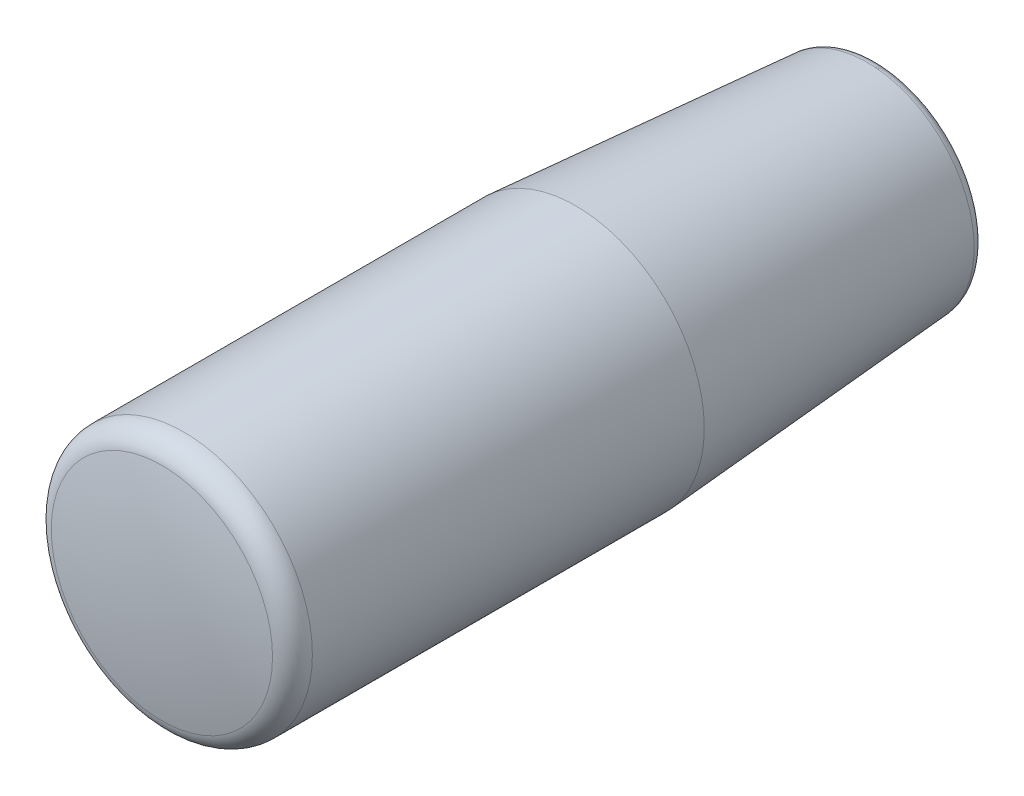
ISO-10303-21;
HEADER;
FILE_DESCRIPTION(('STEP AP214'),'2;1');
FILE_NAME('part.step','',(''),(''),'','','');
FILE_SCHEMA(('AUTOMOTIVE_DESIGN { 1 0 10303 214 1 1 1 1 }'));
ENDSEC;
DATA;
#1=APPLICATION_CONTEXT('core data for automotive mechanical design processes');
#2=APPLICATION_PROTOCOL_DEFINITION('international standard','automotive_design',2000,#1);
#3=PRODUCT_CONTEXT('',#1,'mechanical');
#4=PRODUCT('Part','Part','',(#3));
#5=PRODUCT_RELATED_PRODUCT_CATEGORY('part','',(#4));
#6=PRODUCT_DEFINITION_FORMATION('','',#4);
#7=PRODUCT_DEFINITION_CONTEXT('part definition',#1,'design');
#8=PRODUCT_DEFINITION('design','',#6,#7);
#9=PRODUCT_DEFINITION_SHAPE('','',#8);
#10=(LENGTH_UNIT() NAMED_UNIT(*) SI_UNIT(.MILLI.,.METRE.));
#11=(NAMED_UNIT(*) PLANE_ANGLE_UNIT() SI_UNIT($,.RADIAN.));
#12=(NAMED_UNIT(*) SI_UNIT($,.STERADIAN.) SOLID_ANGLE_UNIT());
#13=UNCERTAINTY_MEASURE_WITH_UNIT(LENGTH_MEASURE(1.E-05),#10,'distance_accuracy_value','');
#14=(GEOMETRIC_REPRESENTATION_CONTEXT(3) GLOBAL_UNCERTAINTY_ASSIGNED_CONTEXT((#13)) GLOBAL_UNIT_ASSIGNED_CONTEXT((#10,
#11,#12)) REPRESENTATION_CONTEXT('',''));
#15=CARTESIAN_POINT('',(0.,0.,0.));
#16=DIRECTION('',(0.,0.,1.));
#17=DIRECTION('',(1.,0.,0.));
#18=AXIS2_PLACEMENT_3D('',#15,#16,#17);
#19=CARTESIAN_POINT('',(0.,0.,62.050504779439));
#20=DIRECTION('',(0.,0.,-1.));
#21=DIRECTION('',(-1.,0.,0.));
#22=AXIS2_PLACEMENT_3D('',#19,#20,#21);
#23=TOROIDAL_SURFACE('',#22,9.5,2.);
#24=CARTESIAN_POINT('',(0.,0.,62.050504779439));
#25=DIRECTION('',(0.,0.,-1.));
#26=DIRECTION('',(-1.,0.,0.));
#27=AXIS2_PLACEMENT_3D('',#24,#25,#26);
#28=CIRCLE('',#27,11.5);
#29=CARTESIAN_POINT('',(-11.5,0.,62.050504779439));
#30=VERTEX_POINT('',#29);
#31=EDGE_CURVE('E8',#30,#30,#28,.T.);
#32=ORIENTED_EDGE('',*,*,#31,.F.);
#33=EDGE_LOOP('',(#32));
#34=FACE_BOUND('',#33,.T.);
#35=CARTESIAN_POINT('',(0.,0.,64.0109423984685));
#36=DIRECTION('',(0.,0.,-1.));
#37=DIRECTION('',(-1.,0.,0.));
#38=AXIS2_PLACEMENT_3D('',#35,#36,#37);
#39=CIRCLE('',#38,9.89583373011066);
#40=CARTESIAN_POINT('',(-9.89583373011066,0.,64.0109423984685));
#41=VERTEX_POINT('',#40);
#42=EDGE_CURVE('E43',#41,#41,#39,.T.);
#43=ORIENTED_EDGE('',*,*,#42,.T.);
#44=EDGE_LOOP('',(#43));
#45=FACE_BOUND('',#44,.T.);
#46=ADVANCED_FACE('F12',(#34,#45),#23,.T.);
#47=CARTESIAN_POINT('',(0.,0.,-5.));
#48=DIRECTION('',(0.,0.,-1.));
#49=DIRECTION('',(-1.,0.,0.));
#50=AXIS2_PLACEMENT_3D('',#47,#48,#49);
#51=CYLINDRICAL_SURFACE('',#50,11.5);
#52=CARTESIAN_POINT('',(0.,0.,27.));
#53=DIRECTION('',(0.,0.,-1.));
#54=DIRECTION('',(-1.,0.,0.));
#55=AXIS2_PLACEMENT_3D('',#52,#53,#54);
#56=CIRCLE('',#55,11.5);
#57=CARTESIAN_POINT('',(-11.5,0.,27.));
#58=VERTEX_POINT('',#57);
#59=EDGE_CURVE('E18',#58,#58,#56,.T.);
#60=ORIENTED_EDGE('',*,*,#59,.F.);
#61=EDGE_LOOP('',(#60));
#62=FACE_BOUND('',#61,.T.);
#63=ORIENTED_EDGE('',*,*,#31,.T.);
#64=EDGE_LOOP('',(#63));
#65=FACE_BOUND('',#64,.T.);
#66=ADVANCED_FACE('F61',(#62,#65),#51,.T.);
#67=CARTESIAN_POINT('',(0.,0.,27.));
#68=DIRECTION('',(0.,0.,1.));
#69=DIRECTION('',(1.,0.,0.));
#70=AXIS2_PLACEMENT_3D('',#67,#68,#69);
#71=CONICAL_SURFACE('',#70,11.5,0.0739390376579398);
#72=CARTESIAN_POINT('',(0.,0.,0.926128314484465));
#73=DIRECTION('',(0.,0.,-1.));
#74=DIRECTION('',(-1.,0.,0.));
#75=AXIS2_PLACEMENT_3D('',#72,#73,#74);
#76=CIRCLE('',#75,9.56860209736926);
#77=CARTESIAN_POINT('',(-9.56860209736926,0.,0.926128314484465));
#78=VERTEX_POINT('',#77);
#79=EDGE_CURVE('E22',#78,#78,#76,.T.);
#80=ORIENTED_EDGE('',*,*,#79,.F.);
#81=EDGE_LOOP('',(#80));
#82=FACE_BOUND('',#81,.T.);
#83=ORIENTED_EDGE('',*,*,#59,.T.);
#84=EDGE_LOOP('',(#83));
#85=FACE_BOUND('',#84,.T.);
#86=ADVANCED_FACE('F67',(#82,#85),#71,.T.);
#87=CARTESIAN_POINT('',(0.,0.,0.999999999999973));
#88=DIRECTION('',(0.,0.,-1.));
#89=DIRECTION('',(-1.,0.,0.));
#90=AXIS2_PLACEMENT_3D('',#87,#88,#89);
#91=TOROIDAL_SURFACE('',#90,8.57133434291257,1.);
#92=CARTESIAN_POINT('',(0.,0.,0.));
#93=DIRECTION('',(0.,0.,-1.));
#94=DIRECTION('',(-1.,0.,0.));
#95=AXIS2_PLACEMENT_3D('',#92,#93,#94);
#96=CIRCLE('',#95,8.57133434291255);
#97=CARTESIAN_POINT('',(-8.57133434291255,0.,0.));
#98=VERTEX_POINT('',#97);
#99=EDGE_CURVE('E26',#98,#98,#96,.T.);
#100=ORIENTED_EDGE('',*,*,#99,.F.);
#101=EDGE_LOOP('',(#100));
#102=FACE_BOUND('',#101,.T.);
#103=ORIENTED_EDGE('',*,*,#79,.T.);
#104=EDGE_LOOP('',(#103));
#105=FACE_BOUND('',#104,.T.);
#106=ADVANCED_FACE('F73',(#102,#105),#91,.T.);
#107=CARTESIAN_POINT('',(0.,8.57133434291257,0.));
#108=DIRECTION('',(0.,0.,1.));
#109=DIRECTION('',(1.,0.,0.));
#110=AXIS2_PLACEMENT_3D('',#107,#108,#109);
#111=PLANE('',#110);
#112=CARTESIAN_POINT('',(0.,0.,0.));
#113=DIRECTION('',(0.,0.,-1.));
#114=DIRECTION('',(-1.,0.,0.));
#115=AXIS2_PLACEMENT_3D('',#112,#113,#114);
#116=CIRCLE('',#115,5.25);
#117=CARTESIAN_POINT('',(-5.25,0.,0.));
#118=VERTEX_POINT('',#117);
#119=EDGE_CURVE('E31',#118,#118,#116,.T.);
#120=ORIENTED_EDGE('',*,*,#119,.F.);
#121=EDGE_LOOP('',(#120));
#122=FACE_BOUND('',#121,.T.);
#123=ORIENTED_EDGE('',*,*,#99,.T.);
#124=EDGE_LOOP('',(#123));
#125=FACE_BOUND('',#124,.T.);
#126=ADVANCED_FACE('F79',(#122,#125),#111,.F.);
#127=CARTESIAN_POINT('',(0.,0.,-5.));
#128=DIRECTION('',(0.,0.,-1.));
#129=DIRECTION('',(-1.,0.,0.));
#130=AXIS2_PLACEMENT_3D('',#127,#128,#129);
#131=CYLINDRICAL_SURFACE('',#130,5.25);
#132=CARTESIAN_POINT('',(0.,0.,7.5));
#133=DIRECTION('',(0.,0.,-1.));
#134=DIRECTION('',(-1.,0.,0.));
#135=AXIS2_PLACEMENT_3D('',#132,#133,#134);
#136=CIRCLE('',#135,5.25);
#137=CARTESIAN_POINT('',(-5.25,0.,7.5));
#138=VERTEX_POINT('',#137);
#139=EDGE_CURVE('E34',#138,#138,#136,.T.);
#140=ORIENTED_EDGE('',*,*,#139,.F.);
#141=EDGE_LOOP('',(#140));
#142=FACE_BOUND('',#141,.T.);
#143=ORIENTED_EDGE('',*,*,#119,.T.);
#144=EDGE_LOOP('',(#143));
#145=FACE_BOUND('',#144,.T.);
#146=ADVANCED_FACE('F83',(#142,#145),#131,.F.);
#147=CARTESIAN_POINT('',(0.,5.25,7.5));
#148=DIRECTION('',(0.,0.,1.));
#149=DIRECTION('',(1.,0.,0.));
#150=AXIS2_PLACEMENT_3D('',#147,#148,#149);
#151=PLANE('',#150);
#152=CARTESIAN_POINT('',(0.,0.,7.5));
#153=DIRECTION('',(0.,0.,-1.));
#154=DIRECTION('',(-1.,0.,0.));
#155=AXIS2_PLACEMENT_3D('',#152,#153,#154);
#156=CIRCLE('',#155,5.);
#157=CARTESIAN_POINT('',(-5.,0.,7.5));
#158=VERTEX_POINT('',#157);
#159=EDGE_CURVE('E37',#158,#158,#156,.T.);
#160=ORIENTED_EDGE('',*,*,#159,.F.);
#161=EDGE_LOOP('',(#160));
#162=FACE_BOUND('',#161,.T.);
#163=ORIENTED_EDGE('',*,*,#139,.T.);
#164=EDGE_LOOP('',(#163));
#165=FACE_BOUND('',#164,.T.);
#166=ADVANCED_FACE('F87',(#162,#165),#151,.F.);
#167=CARTESIAN_POINT('',(0.,0.,-5.));
#168=DIRECTION('',(0.,0.,-1.));
#169=DIRECTION('',(-1.,0.,0.));
#170=AXIS2_PLACEMENT_3D('',#167,#168,#169);
#171=CYLINDRICAL_SURFACE('',#170,5.);
#172=CARTESIAN_POINT('',(0.,0.,40.));
#173=DIRECTION('',(0.,0.,-1.));
#174=DIRECTION('',(-1.,0.,0.));
#175=AXIS2_PLACEMENT_3D('',#172,#173,#174);
#176=CIRCLE('',#175,5.);
#177=CARTESIAN_POINT('',(-5.,0.,40.));
#178=VERTEX_POINT('',#177);
#179=EDGE_CURVE('E40',#178,#178,#176,.T.);
#180=ORIENTED_EDGE('',*,*,#179,.F.);
#181=EDGE_LOOP('',(#180));
#182=FACE_BOUND('',#181,.T.);
#183=ORIENTED_EDGE('',*,*,#159,.T.);
#184=EDGE_LOOP('',(#183));
#185=FACE_BOUND('',#184,.T.);
#186=ADVANCED_FACE('F57',(#182,#185),#171,.F.);
#187=CARTESIAN_POINT('',(0.,5.,40.));
#188=DIRECTION('',(0.,0.,1.));
#189=DIRECTION('',(1.,0.,0.));
#190=AXIS2_PLACEMENT_3D('',#187,#188,#189);
#191=PLANE('',#190);
#192=ORIENTED_EDGE('',*,*,#179,.T.);
#193=EDGE_LOOP('',(#192));
#194=FACE_BOUND('',#193,.T.);
#195=ADVANCED_FACE('F50',(#194),#191,.F.);
#196=CARTESIAN_POINT('',(0.,0.,15.));
#197=DIRECTION('',(-1.,0.,0.));
#198=DIRECTION('',(0.,0.,1.));
#199=AXIS2_PLACEMENT_3D('',#196,#197,#198);
#200=SPHERICAL_SURFACE('',#199,50.);
#201=CARTESIAN_POINT('',(0.,0.,15.));
#202=DIRECTION('',(0.,0.,-1.));
#203=DIRECTION('',(-1.,0.,0.));
#204=AXIS2_PLACEMENT_3D('',#201,#202,#203);
#205=SPHERICAL_SURFACE('',#204,50.);
#206=ORIENTED_EDGE('',*,*,#42,.F.);
#207=EDGE_LOOP('',(#206));
#208=FACE_BOUND('',#207,.T.);
#209=ADVANCED_FACE('F48',(#208),#205,.T.);
#210=CLOSED_SHELL('',(#46,#66,#86,#106,#126,#146,#166,#186,#195,#209));
#211=MANIFOLD_SOLID_BREP('B1',#210);
#212=ADVANCED_BREP_SHAPE_REPRESENTATION('',(#18,#211),#14);
#213=SHAPE_DEFINITION_REPRESENTATION(#9,#212);
ENDSEC;
END-ISO-10303-21;
